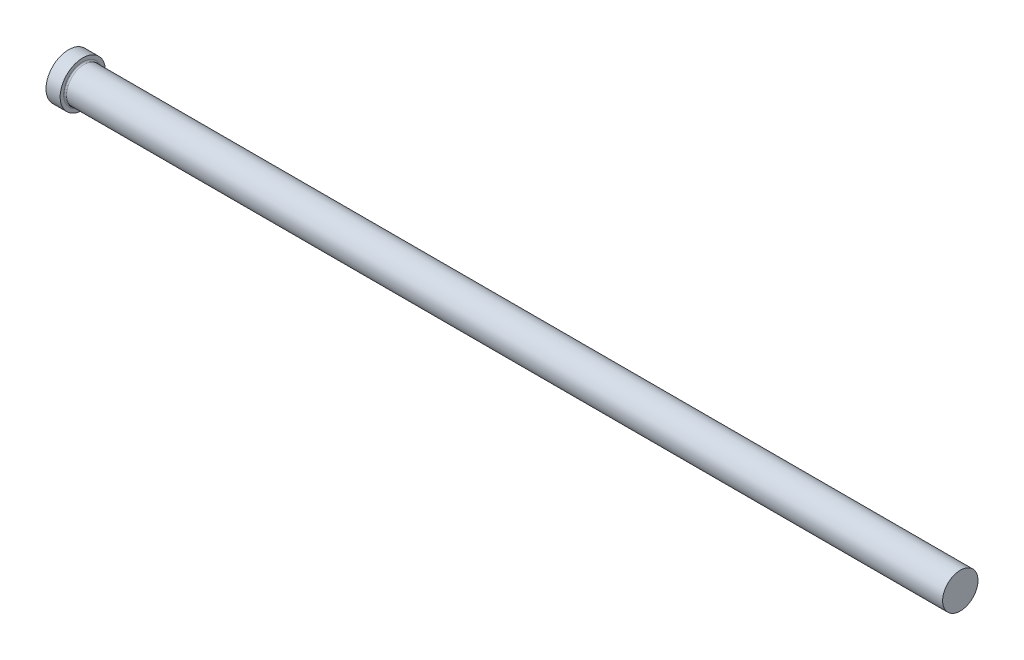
ISO-10303-21;
HEADER;
FILE_DESCRIPTION(('STEP AP214'),'2;1');
FILE_NAME('part.step','',(''),(''),'','','');
FILE_SCHEMA(('AUTOMOTIVE_DESIGN { 1 0 10303 214 1 1 1 1 }'));
ENDSEC;
DATA;
#1=APPLICATION_CONTEXT('core data for automotive mechanical design processes');
#2=APPLICATION_PROTOCOL_DEFINITION('international standard','automotive_design',2000,#1);
#3=PRODUCT_CONTEXT('',#1,'mechanical');
#4=PRODUCT('Part','Part','',(#3));
#5=PRODUCT_RELATED_PRODUCT_CATEGORY('part','',(#4));
#6=PRODUCT_DEFINITION_FORMATION('','',#4);
#7=PRODUCT_DEFINITION_CONTEXT('part definition',#1,'design');
#8=PRODUCT_DEFINITION('design','',#6,#7);
#9=PRODUCT_DEFINITION_SHAPE('','',#8);
#10=(LENGTH_UNIT() NAMED_UNIT(*) SI_UNIT(.MILLI.,.METRE.));
#11=(NAMED_UNIT(*) PLANE_ANGLE_UNIT() SI_UNIT($,.RADIAN.));
#12=(NAMED_UNIT(*) SI_UNIT($,.STERADIAN.) SOLID_ANGLE_UNIT());
#13=UNCERTAINTY_MEASURE_WITH_UNIT(LENGTH_MEASURE(1.E-05),#10,'distance_accuracy_value','');
#14=(GEOMETRIC_REPRESENTATION_CONTEXT(3) GLOBAL_UNCERTAINTY_ASSIGNED_CONTEXT((#13)) GLOBAL_UNIT_ASSIGNED_CONTEXT((#10,
#11,#12)) REPRESENTATION_CONTEXT('',''));
#15=CARTESIAN_POINT('',(0.,0.,0.));
#16=DIRECTION('',(0.,0.,1.));
#17=DIRECTION('',(1.,0.,0.));
#18=AXIS2_PLACEMENT_3D('',#15,#16,#17);
#19=CARTESIAN_POINT('',(0.,0.,0.));
#20=DIRECTION('',(-1.,0.,0.));
#21=DIRECTION('',(0.,-1.,0.));
#22=AXIS2_PLACEMENT_3D('',#19,#20,#21);
#23=PLANE('',#22);
#24=CARTESIAN_POINT('',(0.,0.,0.));
#25=DIRECTION('',(1.,0.,0.));
#26=DIRECTION('',(0.,1.,0.));
#27=AXIS2_PLACEMENT_3D('',#24,#25,#26);
#28=CIRCLE('',#27,16.);
#29=CARTESIAN_POINT('',(0.,16.,0.));
#30=VERTEX_POINT('',#29);
#31=EDGE_CURVE('E25',#30,#30,#28,.T.);
#32=ORIENTED_EDGE('',*,*,#31,.F.);
#33=EDGE_LOOP('',(#32));
#34=FACE_BOUND('',#33,.T.);
#35=ADVANCED_FACE('F14',(#34),#23,.T.);
#36=CARTESIAN_POINT('',(630.,0.,0.));
#37=DIRECTION('',(1.,0.,0.));
#38=DIRECTION('',(0.,1.,0.));
#39=AXIS2_PLACEMENT_3D('',#36,#37,#38);
#40=CYLINDRICAL_SURFACE('',#39,16.);
#41=ORIENTED_EDGE('',*,*,#31,.T.);
#42=EDGE_LOOP('',(#41));
#43=FACE_BOUND('',#42,.T.);
#44=CARTESIAN_POINT('',(10.,0.,0.));
#45=DIRECTION('',(1.,0.,0.));
#46=DIRECTION('',(0.,1.,0.));
#47=AXIS2_PLACEMENT_3D('',#44,#45,#46);
#48=CIRCLE('',#47,16.);
#49=CARTESIAN_POINT('',(10.,16.,0.));
#50=VERTEX_POINT('',#49);
#51=EDGE_CURVE('E29',#50,#50,#48,.T.);
#52=ORIENTED_EDGE('',*,*,#51,.F.);
#53=EDGE_LOOP('',(#52));
#54=FACE_BOUND('',#53,.T.);
#55=ADVANCED_FACE('F51',(#43,#54),#40,.T.);
#56=CARTESIAN_POINT('',(10.,16.,0.));
#57=DIRECTION('',(1.,0.,0.));
#58=DIRECTION('',(0.,1.,0.));
#59=AXIS2_PLACEMENT_3D('',#56,#57,#58);
#60=PLANE('',#59);
#61=CARTESIAN_POINT('',(10.,0.,0.));
#62=DIRECTION('',(1.,0.,0.));
#63=DIRECTION('',(0.,1.,0.));
#64=AXIS2_PLACEMENT_3D('',#61,#62,#63);
#65=CIRCLE('',#64,13.5);
#66=CARTESIAN_POINT('',(10.,13.5,0.));
#67=VERTEX_POINT('',#66);
#68=EDGE_CURVE('E9',#67,#67,#65,.F.);
#69=ORIENTED_EDGE('',*,*,#68,.T.);
#70=EDGE_LOOP('',(#69));
#71=FACE_BOUND('',#70,.T.);
#72=ORIENTED_EDGE('',*,*,#51,.T.);
#73=EDGE_LOOP('',(#72));
#74=FACE_BOUND('',#73,.T.);
#75=ADVANCED_FACE('F42',(#71,#74),#60,.T.);
#76=CARTESIAN_POINT('',(630.,0.,0.));
#77=DIRECTION('',(1.,0.,0.));
#78=DIRECTION('',(0.,1.,0.));
#79=AXIS2_PLACEMENT_3D('',#76,#77,#78);
#80=CYLINDRICAL_SURFACE('',#79,12.5);
#81=CARTESIAN_POINT('',(11.,0.,0.));
#82=DIRECTION('',(1.,0.,0.));
#83=DIRECTION('',(0.,1.,0.));
#84=AXIS2_PLACEMENT_3D('',#81,#82,#83);
#85=CIRCLE('',#84,12.5);
#86=CARTESIAN_POINT('',(11.,12.5,0.));
#87=VERTEX_POINT('',#86);
#88=EDGE_CURVE('E21',#87,#87,#85,.T.);
#89=ORIENTED_EDGE('',*,*,#88,.T.);
#90=EDGE_LOOP('',(#89));
#91=FACE_BOUND('',#90,.T.);
#92=CARTESIAN_POINT('',(630.,0.,0.));
#93=DIRECTION('',(1.,0.,0.));
#94=DIRECTION('',(0.,1.,0.));
#95=AXIS2_PLACEMENT_3D('',#92,#93,#94);
#96=CIRCLE('',#95,12.5);
#97=CARTESIAN_POINT('',(630.,12.5,0.));
#98=VERTEX_POINT('',#97);
#99=EDGE_CURVE('E34',#98,#98,#96,.T.);
#100=ORIENTED_EDGE('',*,*,#99,.F.);
#101=EDGE_LOOP('',(#100));
#102=FACE_BOUND('',#101,.T.);
#103=ADVANCED_FACE('F40',(#91,#102),#80,.T.);
#104=CARTESIAN_POINT('',(630.,12.5,0.));
#105=DIRECTION('',(1.,0.,0.));
#106=DIRECTION('',(0.,1.,0.));
#107=AXIS2_PLACEMENT_3D('',#104,#105,#106);
#108=PLANE('',#107);
#109=ORIENTED_EDGE('',*,*,#99,.T.);
#110=EDGE_LOOP('',(#109));
#111=FACE_BOUND('',#110,.T.);
#112=ADVANCED_FACE('F38',(#111),#108,.T.);
#113=CARTESIAN_POINT('',(11.,0.,0.));
#114=DIRECTION('',(1.,0.,0.));
#115=DIRECTION('',(0.,1.,0.));
#116=AXIS2_PLACEMENT_3D('',#113,#114,#115);
#117=TOROIDAL_SURFACE('',#116,13.5,1.);
#118=ORIENTED_EDGE('',*,*,#68,.F.);
#119=EDGE_LOOP('',(#118));
#120=FACE_BOUND('',#119,.T.);
#121=ORIENTED_EDGE('',*,*,#88,.F.);
#122=EDGE_LOOP('',(#121));
#123=FACE_BOUND('',#122,.T.);
#124=ADVANCED_FACE('F16',(#120,#123),#117,.F.);
#125=CLOSED_SHELL('',(#35,#55,#75,#103,#112,#124));
#126=MANIFOLD_SOLID_BREP('B1',#125);
#127=ADVANCED_BREP_SHAPE_REPRESENTATION('',(#18,#126),#14);
#128=SHAPE_DEFINITION_REPRESENTATION(#9,#127);
ENDSEC;
END-ISO-10303-21;
